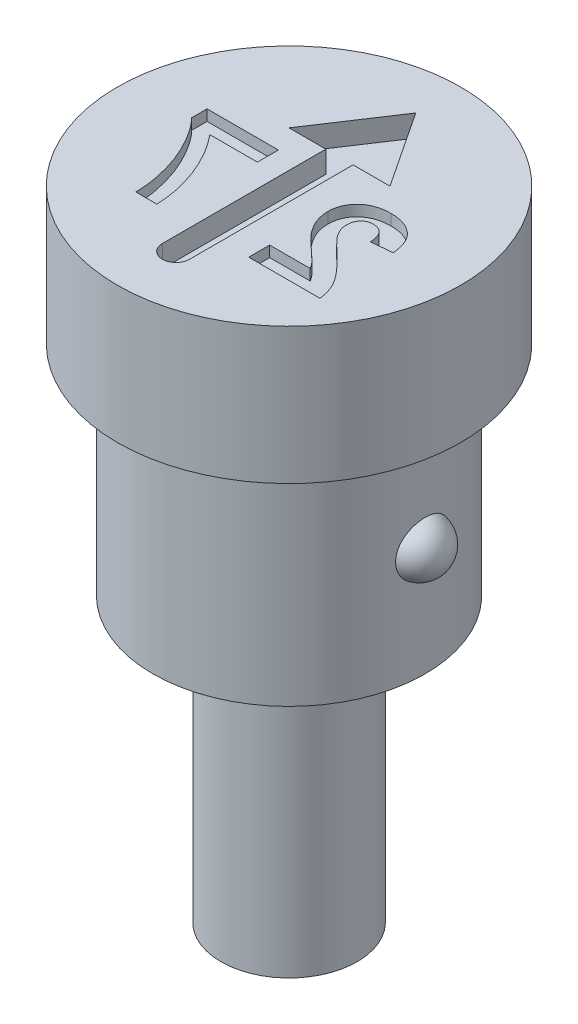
from build123d import *

# Parameters (mm, degrees)
CUT_EXTRUDE1_DEPTH = 0.4
CUT_EXTRUDE2_DEPTH = 0.2


with BuildPart() as part:
    # Sketch1 → Revolve1 (revolve)
    with BuildSketch(Plane.XY, mode=Mode.PRIVATE) as revolve1_sk:
        Polygon((0, 0), (-3.15, 0), (-3.15, -2.5), (-2.5, -2.5), (-2.5, -6.5), (-1.25, -6.5), (-1.25, -11.7), (0, -11.7), align=None)
    revolve(revolve1_sk.sketch.rotate(Axis((0, 0, 0), (0, -1, 0)), 270), axis=Axis((0, 0, 0), (0, -1, 0)))

    # Sketch3 → Cut-Extrude1 (cut)
    with BuildSketch(Plane(origin=(0, 0, 0), x_dir=(1, 0, 0), z_dir=(0, 1, 0))):
        with BuildLine():
            Line((0, 2.325), (-0.926639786, 0.925))
            Line((-0.926639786, 0.925), (-0.25, 0.925))
            Line((-0.25, 0.925), (-0.25, -2.075))
            ThreePointArc((-0.25, -2.075), (0, -2.325), (0.25, -2.075))
            Line((0.25, -2.075), (0.25, 0.925))
            Line((0.25, 0.925), (0.926639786, 0.925))
            Line((0.926639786, 0.925), (0, 2.325))
        make_face()
    extrude(amount=-CUT_EXTRUDE1_DEPTH, mode=Mode.SUBTRACT)

    # Sketch4 → Cut-Extrude2 (cut)
    with BuildSketch(Plane(origin=(0, 0, 0), x_dir=(1, 0, 0), z_dir=(0, 1, 0))):
        with BuildLine():
            Line((0.759195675, -1.11435643), (0.759195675, -1.498971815))
            Line((0.759195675, -1.498971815), (2.066887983, -1.498971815))
            add(Edge.make_bspline(
                [(2.066887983, -1.498971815), (2.06246044, -1.46610085), (2.053607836, -1.400377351), (2.02623875, -1.304371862), (1.989710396, -1.210686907), (1.950065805, -1.134450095), (1.910634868, -1.073082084), (1.874859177, -1.022796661), (1.832180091, -0.96929513), (1.78321693, -0.912145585), (1.728240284, -0.851169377), (1.666839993, -0.786593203), (1.598723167, -0.718726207), (1.550801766, -0.672641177), (1.526022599, -0.648811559)],
                knots=[0, 0, 0, 0, 1.156289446, 2.311930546, 3.473459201, 4.661751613, 5.303057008, 6.018253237, 6.81459331, 7.690699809, 8.644447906, 9.679642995, 10.800191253, 12, 12, 12, 12], degree=3))
            add(Edge.make_bspline(
                [(1.526022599, -0.648811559), (1.506248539, -0.629724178), (1.468604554, -0.593387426), (1.414999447, -0.541354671), (1.367875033, -0.493521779), (1.326246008, -0.451128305), (1.291074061, -0.413094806), (1.261896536, -0.380018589), (1.238343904, -0.35176496), (1.225587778, -0.33384084), (1.219932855, -0.325894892)],
                knots=[0, 0, 0, 0, 1.480720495, 2.818855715, 4.024636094, 5.098235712, 6.019786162, 6.815086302, 7.474715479, 8, 8, 8, 8], degree=3))
            add(Edge.make_bspline(
                [(1.219932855, -0.325894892), (1.208352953, -0.306659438), (1.186016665, -0.269556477), (1.161523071, -0.211211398), (1.146821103, -0.152878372), (1.144803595, -0.113900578), (1.14381106, -0.09472502)],
                knots=[0, 0, 0, 0, 1.0911822, 2.104764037, 3.067617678, 4, 4, 4, 4], degree=3))
            add(Edge.make_bspline(
                [(1.14381106, -0.09472502), (1.144531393, -0.074770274), (1.145894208, -0.037017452), (1.157321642, 0.016258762), (1.177586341, 0.062057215), (1.205487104, 0.100518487), (1.240767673, 0.130652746), (1.282011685, 0.152919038), (1.329822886, 0.165229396), (1.363427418, 0.166848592), (1.380990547, 0.167694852)],
                knots=[0, 0, 0, 0, 1.193122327, 2.257294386, 3.237245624, 4.168877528, 5.075331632, 5.990371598, 6.949684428, 8, 8, 8, 8], degree=3))
            add(Edge.make_bspline(
                [(1.380990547, 0.167694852), (1.398435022, 0.166904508), (1.43213398, 0.165377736), (1.480027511, 0.152040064), (1.521925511, 0.12895115), (1.551784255, 0.102639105), (1.571955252, 0.077052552), (1.585699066, 0.054755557), (1.597545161, 0.029419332), (1.608041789, 0.001329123), (1.616332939, -0.029836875), (1.623010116, -0.063841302), (1.628390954, -0.100867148), (1.630102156, -0.126624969), (1.630990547, -0.139997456)],
                knots=[0, 0, 0, 0, 1.402788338, 2.709884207, 3.961032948, 5.225417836, 5.883680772, 6.578928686, 7.329201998, 8.132101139, 8.990263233, 9.922304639, 10.921339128, 12, 12, 12, 12], degree=3))
            Line((1.630990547, -0.139997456), (2.015605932, -0.1023372))
            add(Edge.make_bspline(
                [(2.015605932, -0.1023372), (2.012513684, -0.076370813), (2.006518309, -0.026026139), (1.99155675, 0.046286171), (1.97260849, 0.112997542), (1.948770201, 0.173984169), (1.92102715, 0.229633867), (1.887964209, 0.279111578), (1.850736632, 0.322965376), (1.809312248, 0.36117192), (1.763954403, 0.393852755), (1.716359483, 0.423025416), (1.665597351, 0.446956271), (1.6122269, 0.466678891), (1.556272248, 0.482441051), (1.497474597, 0.492862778), (1.436196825, 0.500193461), (1.394368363, 0.50074575), (1.372977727, 0.501028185)],
                knots=[0, 0, 0, 0, 1.270971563, 2.464210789, 3.586263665, 4.638946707, 5.643716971, 6.603612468, 7.52484387, 8.434700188, 9.336036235, 10.239171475, 11.145359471, 12.059630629, 13.003312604, 13.96741569, 14.960557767, 16, 16, 16, 16], degree=3))
            add(Edge.make_bspline(
                [(1.372977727, 0.501028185), (1.349723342, 0.500581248), (1.304432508, 0.499710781), (1.238315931, 0.492522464), (1.176204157, 0.47998859), (1.117554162, 0.463385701), (1.062968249, 0.44121963), (1.011991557, 0.414421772), (0.965426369, 0.381975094), (0.922578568, 0.345649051), (0.884276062, 0.305702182), (0.850726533, 0.263092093), (0.822618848, 0.217848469), (0.799032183, 0.170522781), (0.781519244, 0.12035349), (0.768758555, 0.0680343), (0.760297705, 0.01332113), (0.759567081, -0.024046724), (0.759195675, -0.043042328)],
                knots=[0, 0, 0, 0, 1.210756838, 2.35810096, 3.457354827, 4.507168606, 5.527358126, 6.519769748, 7.499700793, 8.476517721, 9.440526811, 10.376769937, 11.295256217, 12.209626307, 13.124630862, 14.055668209, 15.011616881, 16, 16, 16, 16], degree=3))
            add(Edge.make_bspline(
                [(0.759195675, -0.043042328), (0.759684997, -0.064843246), (0.760655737, -0.108092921), (0.769949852, -0.172028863), (0.784149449, -0.234490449), (0.805135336, -0.295630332), (0.831736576, -0.356915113), (0.866026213, -0.418482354), (0.905839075, -0.482188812), (0.937010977, -0.523377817), (0.953105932, -0.544644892)],
                knots=[0, 0, 0, 0, 0.953409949, 1.89141903, 2.821310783, 3.752688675, 4.715703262, 5.740811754, 6.833515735, 8, 8, 8, 8], degree=3))
            add(Edge.make_bspline(
                [(0.953105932, -0.544644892), (0.959189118, -0.552306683), (0.972217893, -0.568716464), (0.994383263, -0.593878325), (1.020071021, -0.621363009), (1.048918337, -0.651684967), (1.081878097, -0.683770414), (1.117764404, -0.718961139), (1.158156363, -0.755457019), (1.199992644, -0.79416845), (1.242010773, -0.831845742), (1.280631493, -0.867630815), (1.315711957, -0.89929292), (1.345618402, -0.928579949), (1.372109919, -0.953493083), (1.394231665, -0.975309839), (1.412397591, -0.993502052), (1.437429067, -1.021859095), (1.46927878, -1.060212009), (1.491686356, -1.096859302), (1.502384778, -1.11435643)],
                knots=[0, 0, 0, 0, 0.665555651, 1.425465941, 2.280616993, 3.225313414, 4.272635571, 5.410053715, 6.644756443, 7.976022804, 9.288331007, 10.484517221, 11.558462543, 12.503158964, 13.33222979, 14.032602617, 14.617328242, 15.080653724, 16.606167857, 18, 18, 18, 18], degree=3))
            Line((1.502384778, -1.11435643), (0.759195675, -1.11435643))
        make_face()
        with BuildLine():
            Line((-0.671573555, 0.090771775), (-0.671573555, 0.475387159))
            Line((-0.671573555, 0.475387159), (-1.979265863, 0.475387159))
            Line((-1.979265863, 0.475387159), (-1.979265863, 0.193335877))
            add(Edge.make_bspline(
                [(-1.979265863, 0.193335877), (-1.965624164, 0.179455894), (-1.937580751, 0.150922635), (-1.897411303, 0.10422512), (-1.856646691, 0.053550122), (-1.816139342, -0.001785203), (-1.774630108, -0.060906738), (-1.733943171, -0.124947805), (-1.692677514, -0.1930776), (-1.637120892, -0.289447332), (-1.572182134, -0.415335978), (-1.503480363, -0.571821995), (-1.444949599, -0.733113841), (-1.404870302, -0.870546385), (-1.377790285, -0.980698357), (-1.360097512, -1.06124409), (-1.345203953, -1.139523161), (-1.333088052, -1.215673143), (-1.324045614, -1.289728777), (-1.316900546, -1.361432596), (-1.31337547, -1.430959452), (-1.312855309, -1.476532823), (-1.312599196, -1.498971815)],
                knots=[0, 0, 0, 0, 0.628545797, 1.29210959, 1.98878689, 2.729126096, 3.507039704, 4.322017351, 5.179550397, 6.080149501, 7.915136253, 9.752312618, 11.597470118, 13.454141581, 14.373891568, 15.261584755, 16.117868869, 16.947726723, 17.752002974, 18.527724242, 19.275094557, 20, 20, 20, 20], degree=3))
            Line((-1.312599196, -1.498971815), (-0.927983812, -1.498971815))
            add(Edge.make_bspline(
                [(-0.927983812, -1.498971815), (-0.929269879, -1.464899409), (-0.9318563, -1.396376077), (-0.941533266, -1.293524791), (-0.956731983, -1.190290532), (-0.975609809, -1.086434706), (-1.000533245, -0.982210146), (-1.028978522, -0.877230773), (-1.063435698, -0.772057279), (-1.102061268, -0.666890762), (-1.144701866, -0.562729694), (-1.191174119, -0.460866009), (-1.24135789, -0.361935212), (-1.294600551, -0.265589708), (-1.351521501, -0.172139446), (-1.412163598, -0.081685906), (-1.475666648, 0.006425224), (-1.521072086, 0.062660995), (-1.543769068, 0.090771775)],
                knots=[0, 0, 0, 0, 0.943249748, 1.896978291, 2.856365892, 3.829648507, 4.816416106, 5.820376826, 6.838120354, 7.877341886, 8.919613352, 9.951365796, 10.974227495, 11.988073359, 12.996274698, 14.000568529, 15.000536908, 16, 16, 16, 16], degree=3))
            Line((-1.543769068, 0.090771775), (-0.671573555, 0.090771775))
        make_face()
    extrude(amount=-CUT_EXTRUDE2_DEPTH, mode=Mode.SUBTRACT)

    # Sketch5 → Revolve2 (revolve)
    with BuildSketch(Plane.XY):
        with BuildLine():
            Line((2.388481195, -4), (2.388481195, -5))
            ThreePointArc((2.388481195, -5), (2.888481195, -4.5), (2.388481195, -4))
        make_face()
    revolve(axis=Axis((2.388481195, -4, 0), (0, -1, 0)))


solid = part.part
